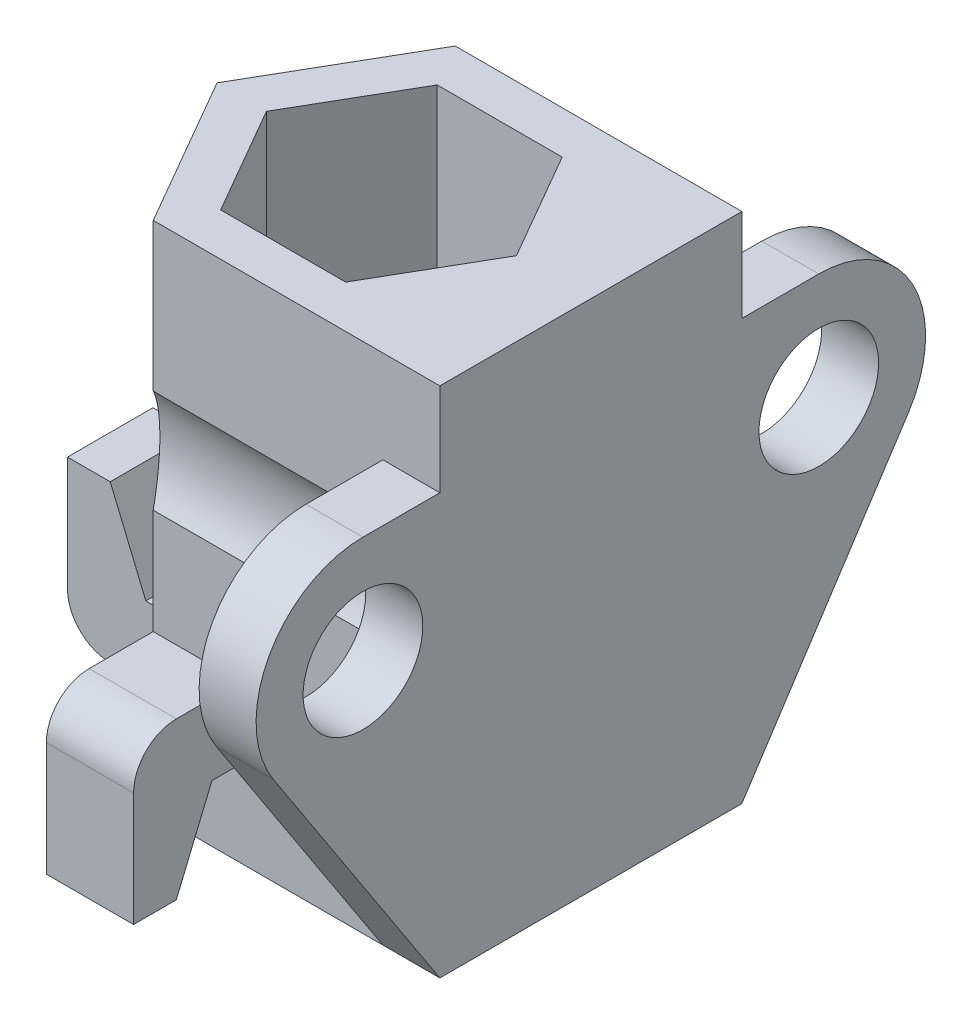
from build123d import *
from OCP.BRepFilletAPI import BRepFilletAPI_MakeChamfer

# Parameters (mm, degrees)
BOSS_EXTRU_1_DEPTH      = 18
ESQUISSE4_R             = 2.1
BOSS_EXTRU_2_DEPTH      = 2
BOSS_EXTRU_3_DEPTH      = 3.059956
BOSS_EXTRU_4_DEPTH      = 1.5
BOSS_EXTRU_4_DEPTH_BACK = 1.5
ESQUISSE8_W             = 3
ESQUISSE8_H             = 2.5
BOSS_EXTRU_5_DEPTH      = 1.732051
CONG_5_R                = 1.5
ENL_V_MAT_EXTRU_2_DEPTH = 11.11991
CHANFREIN1_SIZE         = 1.25
CHANFREIN1_SIZE2        = 0.75


with BuildPart() as part:
    # Esquisse2 → Boss.-Extru.1 (new body)
    with BuildSketch(Plane(origin=(0, 0, 0), x_dir=(1, 0, 0), z_dir=(0, 1, 0))):
        Polygon((3.059956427, 5.3), (-3.059956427, 5.3), (-6.119912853, 0), (-3.059956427, -5.3), (3.059956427, -5.3), (7, -5.3), (7, 5.3), align=None)
        Polygon((4.387862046, 0), (2.193931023, 3.8), (-2.193931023, 3.8), (-4.387862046, 0), (-2.193931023, -3.8), (2.193931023, -3.8), align=None, mode=Mode.SUBTRACT)
    extrude(amount=BOSS_EXTRU_1_DEPTH)

    # Esquisse4 → Boss.-Extru.2 (add)
    # profile 1 of 2: a face of its own
    with BuildSketch(Plane(origin=(7, 0, 0), x_dir=(0, 0, -1), z_dir=(1, 0, 0))):
        with BuildLine():
            Line((-11.140540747, 8.950730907), (-5.3, 0))
            Line((-5.3, 0), (-5.3, 14.75))
            Line((-5.3, 14.75), (-8, 14.75))
            ThreePointArc((-8, 14.75), (-11.297518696, 12.785740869), (-11.140540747, 8.950730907))
        make_face()
        with Locations((-8, 11)):
            Circle(ESQUISSE4_R, mode=Mode.SUBTRACT)
    # profile 2 of 2: a face of its own
    with BuildSketch(Plane(origin=(7, 0, 0), x_dir=(0, 0, -1), z_dir=(1, 0, 0))):
        with BuildLine():
            Line((5.3, 14.75), (5.3, 0))
            Line((5.3, 0), (11.140540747, 8.950730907))
            ThreePointArc((11.140540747, 8.950730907), (11.297518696, 12.785740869), (8, 14.75))
            Line((8, 14.75), (5.3, 14.75))
        make_face()
        with Locations(Location((8, 11, 0), (0, 0, 180))):
            Circle(ESQUISSE4_R, mode=Mode.SUBTRACT)
    extrude(amount=-BOSS_EXTRU_2_DEPTH)

    # Esquisse6 → Boss.-Extru.3 (add)
    with BuildSketch(Plane(origin=(0, 0, 0), x_dir=(0, 0, -1), z_dir=(1, 0, 0))):
        Polygon((5.3, 3), (6.3, 3), (7.55, 0), (9.05, 0), (9.05, 5.5), (5.3, 5.5), align=None)
        Polygon((-5.3, 5.5), (-5.3, 3), (-6.3, 3), (-7.55, 0), (-9.05, 0), (-9.05, 5.5), align=None)
    extrude(amount=-BOSS_EXTRU_3_DEPTH)



with BuildPart() as body_2:
    # Esquisse7 → Boss.-Extru.4 (new, two sides: drawn at the far end of the back side and taken through both)
    with BuildSketch(Plane.XY.offset(-BOSS_EXTRU_4_DEPTH_BACK)):
        Polygon((-6.119912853, 0), (-9.869912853, 0), (-9.869912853, 5.5), (-8.369912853, 5.5), (-7.119912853, 2.5), (-6.119912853, 2.5), align=None)
    extrude(amount=BOSS_EXTRU_4_DEPTH + BOSS_EXTRU_4_DEPTH_BACK)


with BuildPart() as part_1:
    add(part.part)

    add(body_2.part)  # Boss.-Extru.5 merges body 2
    # Esquisse8 → Boss.-Extru.5 (add)
    with BuildSketch(Plane(origin=(-6.119912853, 0, 0), x_dir=(0, 0, -1), z_dir=(1, 0, 0))):
        with Locations((0, 1.25)):
            Rectangle(ESQUISSE8_W, ESQUISSE8_H)
    extrude(amount=BOSS_EXTRU_5_DEPTH)

    # Cong_5
    cong_5_edges = [part_1.edges().sort_by_distance(p)[0] for p in [
        (-9.869912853, 0, 0),
        (-1.529978, 5.5, -9.05),
        (-1.529978, 5.5, 9.05),
    ]]
    fillet(cong_5_edges, radius=CONG_5_R)

    # Esquisse9 → Enl_v. mat.-Extru.2 (cut)
    with BuildSketch(Plane.ZY.offset(-5)):
        with BuildLine():
            Line((-5.3, 12.809005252), (-5.3, 9.190994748))
            ThreePointArc((-5.3, 9.190994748), (-4.75, 11), (-5.3, 12.809005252))
        make_face()
        with BuildLine():
            Line((5.3, 12.809005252), (5.3, 9.190994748))
            ThreePointArc((5.3, 9.190994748), (4.75, 11), (5.3, 12.809005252))
        make_face()
    extrude(amount=ENL_V_MAT_EXTRU_2_DEPTH, mode=Mode.SUBTRACT)

    # Chanfrein1: one chamfer whose edges measure the first distance from different faces: ONE call of the kernel's chamfer builder (chamfer() names one face for all edges)
    chanfrein1_edges_1 = [part_1.edges().sort_by_distance(p)[0] for p in [
        (3.290896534, 0, 1.9),
    ]]
    chanfrein1_side_1 = [part_1.faces().sort_by_distance(p)[0] for p in [
        (3.290896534, 9, 1.9),
    ]]
    chanfrein1_edges_2 = [part_1.edges().sort_by_distance(p)[0] for p in [
        (3.290896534, 0, -1.9),
    ]]
    chanfrein1_side_2 = [part_1.faces().sort_by_distance(p)[0] for p in [
        (3.290896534, 9, -1.9),
    ]]
    chanfrein1_edges_3 = [part_1.edges().sort_by_distance(p)[0] for p in [
        (0, 0, -3.8),
    ]]
    chanfrein1_side_3 = [part_1.faces().sort_by_distance(p)[0] for p in [
        (0, 9, -3.8),
    ]]
    chanfrein1_edges_4 = [part_1.edges().sort_by_distance(p)[0] for p in [
        (-3.290896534, 0, -1.9),
    ]]
    chanfrein1_side_4 = [part_1.faces().sort_by_distance(p)[0] for p in [
        (-3.290896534, 9, -1.9),
    ]]
    chanfrein1_edges_5 = [part_1.edges().sort_by_distance(p)[0] for p in [
        (-3.290896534, 0, 1.9),
    ]]
    chanfrein1_side_5 = [part_1.faces().sort_by_distance(p)[0] for p in [
        (-3.290896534, 9, 1.9),
    ]]
    chanfrein1_edges_6 = [part_1.edges().sort_by_distance(p)[0] for p in [
        (0, 0, 3.8),
    ]]
    chanfrein1_side_6 = [part_1.faces().sort_by_distance(p)[0] for p in [
        (0, 9, 3.8),
    ]]
    chanfrein1 = BRepFilletAPI_MakeChamfer(part_1.part.solid().wrapped)
    for e in chanfrein1_edges_1:
        chanfrein1.Add(CHANFREIN1_SIZE, CHANFREIN1_SIZE2, e.wrapped, chanfrein1_side_1[0].wrapped)  # the first distance lies on this face
    for e in chanfrein1_edges_2:
        chanfrein1.Add(CHANFREIN1_SIZE, CHANFREIN1_SIZE2, e.wrapped, chanfrein1_side_2[0].wrapped)  # the first distance lies on this face
    for e in chanfrein1_edges_3:
        chanfrein1.Add(CHANFREIN1_SIZE, CHANFREIN1_SIZE2, e.wrapped, chanfrein1_side_3[0].wrapped)  # the first distance lies on this face
    for e in chanfrein1_edges_4:
        chanfrein1.Add(CHANFREIN1_SIZE, CHANFREIN1_SIZE2, e.wrapped, chanfrein1_side_4[0].wrapped)  # the first distance lies on this face
    for e in chanfrein1_edges_5:
        chanfrein1.Add(CHANFREIN1_SIZE, CHANFREIN1_SIZE2, e.wrapped, chanfrein1_side_5[0].wrapped)  # the first distance lies on this face
    for e in chanfrein1_edges_6:
        chanfrein1.Add(CHANFREIN1_SIZE, CHANFREIN1_SIZE2, e.wrapped, chanfrein1_side_6[0].wrapped)  # the first distance lies on this face
    add(Compound.cast(chanfrein1.Shape()), mode=Mode.REPLACE)


solid = part_1.part
